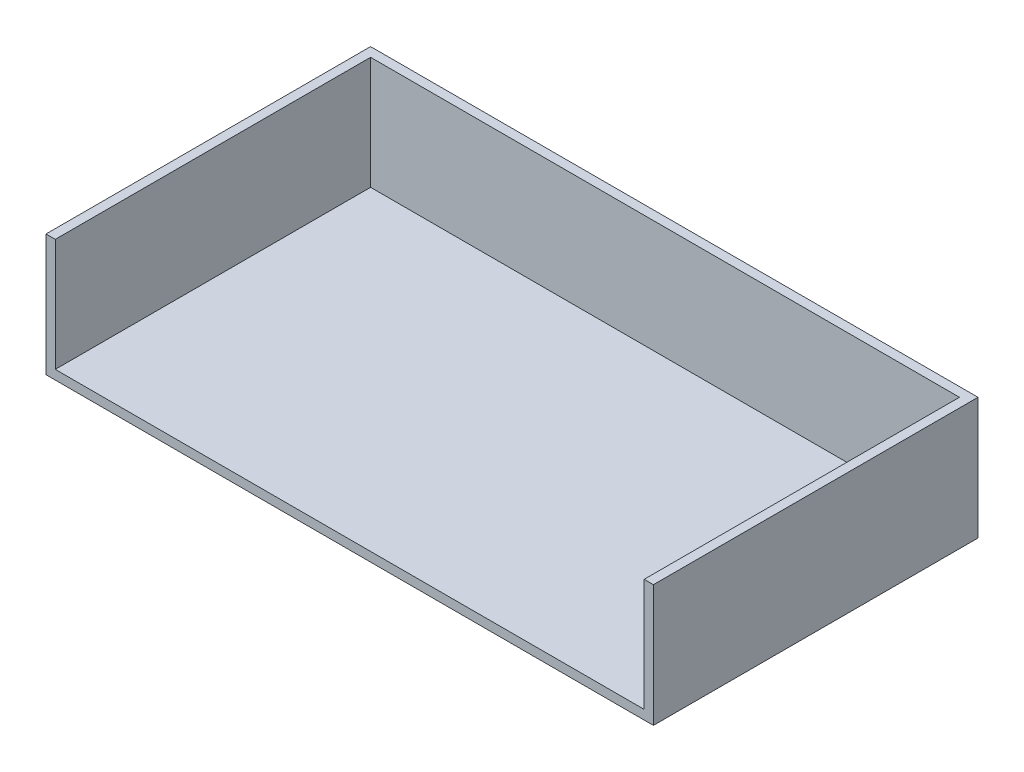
ISO-10303-21;
HEADER;
FILE_DESCRIPTION(('STEP AP214'),'2;1');
FILE_NAME('part.step','',(''),(''),'','','');
FILE_SCHEMA(('AUTOMOTIVE_DESIGN { 1 0 10303 214 1 1 1 1 }'));
ENDSEC;
DATA;
#1=APPLICATION_CONTEXT('core data for automotive mechanical design processes');
#2=APPLICATION_PROTOCOL_DEFINITION('international standard','automotive_design',2000,#1);
#3=PRODUCT_CONTEXT('',#1,'mechanical');
#4=PRODUCT('Part','Part','',(#3));
#5=PRODUCT_RELATED_PRODUCT_CATEGORY('part','',(#4));
#6=PRODUCT_DEFINITION_FORMATION('','',#4);
#7=PRODUCT_DEFINITION_CONTEXT('part definition',#1,'design');
#8=PRODUCT_DEFINITION('design','',#6,#7);
#9=PRODUCT_DEFINITION_SHAPE('','',#8);
#10=(LENGTH_UNIT() NAMED_UNIT(*) SI_UNIT(.MILLI.,.METRE.));
#11=(NAMED_UNIT(*) PLANE_ANGLE_UNIT() SI_UNIT($,.RADIAN.));
#12=(NAMED_UNIT(*) SI_UNIT($,.STERADIAN.) SOLID_ANGLE_UNIT());
#13=UNCERTAINTY_MEASURE_WITH_UNIT(LENGTH_MEASURE(1.E-05),#10,'distance_accuracy_value','');
#14=(GEOMETRIC_REPRESENTATION_CONTEXT(3) GLOBAL_UNCERTAINTY_ASSIGNED_CONTEXT((#13)) GLOBAL_UNIT_ASSIGNED_CONTEXT((#10,
#11,#12)) REPRESENTATION_CONTEXT('',''));
#15=CARTESIAN_POINT('',(0.,0.,0.));
#16=DIRECTION('',(0.,0.,1.));
#17=DIRECTION('',(1.,0.,0.));
#18=AXIS2_PLACEMENT_3D('',#15,#16,#17);
#19=CARTESIAN_POINT('',(0.,0.,70.));
#20=DIRECTION('',(1.,0.,0.));
#21=DIRECTION('',(0.,0.,-1.));
#22=AXIS2_PLACEMENT_3D('',#19,#20,#21);
#23=PLANE('',#22);
#24=DIRECTION('',(0.,-1.,0.));
#25=VECTOR('',#24,1.);
#26=CARTESIAN_POINT('',(0.,0.,0.));
#27=LINE('',#26,#25);
#28=CARTESIAN_POINT('',(0.,26.29,0.));
#29=VERTEX_POINT('',#28);
#30=CARTESIAN_POINT('',(0.,0.,0.));
#31=VERTEX_POINT('',#30);
#32=EDGE_CURVE('E138',#29,#31,#27,.T.);
#33=ORIENTED_EDGE('',*,*,#32,.T.);
#34=DIRECTION('',(0.,0.,-1.));
#35=VECTOR('',#34,1.);
#36=CARTESIAN_POINT('',(0.,0.,70.));
#37=LINE('',#36,#35);
#38=CARTESIAN_POINT('',(0.,0.,70.));
#39=VERTEX_POINT('',#38);
#40=EDGE_CURVE('E11',#39,#31,#37,.T.);
#41=ORIENTED_EDGE('',*,*,#40,.F.);
#42=DIRECTION('',(0.,-1.,0.));
#43=VECTOR('',#42,1.);
#44=CARTESIAN_POINT('',(0.,0.,70.));
#45=LINE('',#44,#43);
#46=CARTESIAN_POINT('',(0.,26.29,70.));
#47=VERTEX_POINT('',#46);
#48=EDGE_CURVE('E131',#47,#39,#45,.T.);
#49=ORIENTED_EDGE('',*,*,#48,.F.);
#50=DIRECTION('',(0.,0.,-1.));
#51=VECTOR('',#50,1.);
#52=CARTESIAN_POINT('',(0.,26.29,70.));
#53=LINE('',#52,#51);
#54=EDGE_CURVE('E137',#47,#29,#53,.T.);
#55=ORIENTED_EDGE('',*,*,#54,.T.);
#56=EDGE_LOOP('',(#33,#41,#49,#55));
#57=FACE_BOUND('',#56,.T.);
#58=ADVANCED_FACE('F31',(#57),#23,.F.);
#59=CARTESIAN_POINT('',(0.,0.,70.));
#60=DIRECTION('',(0.,1.,0.));
#61=DIRECTION('',(0.,0.,1.));
#62=AXIS2_PLACEMENT_3D('',#59,#60,#61);
#63=PLANE('',#62);
#64=DIRECTION('',(1.,0.,0.));
#65=VECTOR('',#64,1.);
#66=CARTESIAN_POINT('',(0.,0.,0.));
#67=LINE('',#66,#65);
#68=CARTESIAN_POINT('',(131.,0.,0.));
#69=VERTEX_POINT('',#68);
#70=EDGE_CURVE('E141',#31,#69,#67,.T.);
#71=ORIENTED_EDGE('',*,*,#70,.T.);
#72=DIRECTION('',(0.,0.,-1.));
#73=VECTOR('',#72,1.);
#74=CARTESIAN_POINT('',(131.,0.,70.));
#75=LINE('',#74,#73);
#76=CARTESIAN_POINT('',(131.,0.,70.));
#77=VERTEX_POINT('',#76);
#78=EDGE_CURVE('E38',#77,#69,#75,.T.);
#79=ORIENTED_EDGE('',*,*,#78,.F.);
#80=DIRECTION('',(1.,0.,0.));
#81=VECTOR('',#80,1.);
#82=CARTESIAN_POINT('',(0.,0.,70.));
#83=LINE('',#82,#81);
#84=EDGE_CURVE('E83',#39,#77,#83,.T.);
#85=ORIENTED_EDGE('',*,*,#84,.F.);
#86=ORIENTED_EDGE('',*,*,#40,.T.);
#87=EDGE_LOOP('',(#71,#79,#85,#86));
#88=FACE_BOUND('',#87,.T.);
#89=ADVANCED_FACE('F185',(#88),#63,.F.);
#90=CARTESIAN_POINT('',(131.,0.,70.));
#91=DIRECTION('',(-1.,0.,0.));
#92=DIRECTION('',(0.,0.,1.));
#93=AXIS2_PLACEMENT_3D('',#90,#91,#92);
#94=PLANE('',#93);
#95=DIRECTION('',(0.,1.,0.));
#96=VECTOR('',#95,1.);
#97=CARTESIAN_POINT('',(131.,0.,0.));
#98=LINE('',#97,#96);
#99=CARTESIAN_POINT('',(131.,26.29,0.));
#100=VERTEX_POINT('',#99);
#101=EDGE_CURVE('E144',#69,#100,#98,.T.);
#102=ORIENTED_EDGE('',*,*,#101,.T.);
#103=DIRECTION('',(0.,0.,-1.));
#104=VECTOR('',#103,1.);
#105=CARTESIAN_POINT('',(131.,26.29,70.));
#106=LINE('',#105,#104);
#107=CARTESIAN_POINT('',(131.,26.29,70.));
#108=VERTEX_POINT('',#107);
#109=EDGE_CURVE('E148',#108,#100,#106,.T.);
#110=ORIENTED_EDGE('',*,*,#109,.F.);
#111=DIRECTION('',(0.,1.,0.));
#112=VECTOR('',#111,1.);
#113=CARTESIAN_POINT('',(131.,0.,70.));
#114=LINE('',#113,#112);
#115=EDGE_CURVE('E134',#77,#108,#114,.T.);
#116=ORIENTED_EDGE('',*,*,#115,.F.);
#117=ORIENTED_EDGE('',*,*,#78,.T.);
#118=EDGE_LOOP('',(#102,#110,#116,#117));
#119=FACE_BOUND('',#118,.T.);
#120=ADVANCED_FACE('F153',(#119),#94,.F.);
#121=CARTESIAN_POINT('',(0.,26.29,70.));
#122=DIRECTION('',(0.,-1.,0.));
#123=DIRECTION('',(0.,0.,-1.));
#124=AXIS2_PLACEMENT_3D('',#121,#122,#123);
#125=PLANE('',#124);
#126=DIRECTION('',(-1.,0.,0.));
#127=VECTOR('',#126,1.);
#128=CARTESIAN_POINT('',(0.,26.29,70.));
#129=LINE('',#128,#127);
#130=CARTESIAN_POINT('',(2.00000000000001,26.29,70.));
#131=VERTEX_POINT('',#130);
#132=EDGE_CURVE('E54',#131,#47,#129,.T.);
#133=ORIENTED_EDGE('',*,*,#132,.F.);
#134=DIRECTION('',(0.,0.,1.));
#135=VECTOR('',#134,1.);
#136=CARTESIAN_POINT('',(2.,26.29,2.));
#137=LINE('',#136,#135);
#138=CARTESIAN_POINT('',(2.,26.29,2.));
#139=VERTEX_POINT('',#138);
#140=EDGE_CURVE('E119',#139,#131,#137,.T.);
#141=ORIENTED_EDGE('',*,*,#140,.F.);
#142=DIRECTION('',(-1.,0.,0.));
#143=VECTOR('',#142,1.);
#144=CARTESIAN_POINT('',(2.,26.29,2.));
#145=LINE('',#144,#143);
#146=CARTESIAN_POINT('',(129.,26.29,2.));
#147=VERTEX_POINT('',#146);
#148=EDGE_CURVE('E165',#147,#139,#145,.T.);
#149=ORIENTED_EDGE('',*,*,#148,.F.);
#150=DIRECTION('',(0.,0.,-1.));
#151=VECTOR('',#150,1.);
#152=CARTESIAN_POINT('',(129.,26.29,2.));
#153=LINE('',#152,#151);
#154=CARTESIAN_POINT('',(129.,26.29,70.));
#155=VERTEX_POINT('',#154);
#156=EDGE_CURVE('E168',#155,#147,#153,.T.);
#157=ORIENTED_EDGE('',*,*,#156,.F.);
#158=EDGE_CURVE('E124',#108,#155,#129,.T.);
#159=ORIENTED_EDGE('',*,*,#158,.F.);
#160=ORIENTED_EDGE('',*,*,#109,.T.);
#161=DIRECTION('',(-1.,0.,0.));
#162=VECTOR('',#161,1.);
#163=CARTESIAN_POINT('',(0.,26.29,0.));
#164=LINE('',#163,#162);
#165=EDGE_CURVE('E76',#100,#29,#164,.T.);
#166=ORIENTED_EDGE('',*,*,#165,.T.);
#167=ORIENTED_EDGE('',*,*,#54,.F.);
#168=EDGE_LOOP('',(#133,#141,#149,#157,#159,#160,#166,#167));
#169=FACE_BOUND('',#168,.T.);
#170=ADVANCED_FACE('F161',(#169),#125,.F.);
#171=CARTESIAN_POINT('',(0.,26.29,70.));
#172=DIRECTION('',(0.,0.,-1.));
#173=DIRECTION('',(-1.,0.,0.));
#174=AXIS2_PLACEMENT_3D('',#171,#172,#173);
#175=PLANE('',#174);
#176=DIRECTION('',(1.,0.,0.));
#177=VECTOR('',#176,1.);
#178=CARTESIAN_POINT('',(2.00000000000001,2.,70.));
#179=LINE('',#178,#177);
#180=CARTESIAN_POINT('',(2.,2.,70.));
#181=VERTEX_POINT('',#180);
#182=CARTESIAN_POINT('',(129.,2.,70.));
#183=VERTEX_POINT('',#182);
#184=EDGE_CURVE('E115',#181,#183,#179,.T.);
#185=ORIENTED_EDGE('',*,*,#184,.F.);
#186=DIRECTION('',(0.,1.,0.));
#187=VECTOR('',#186,1.);
#188=CARTESIAN_POINT('',(2.00000000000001,2.,70.));
#189=LINE('',#188,#187);
#190=EDGE_CURVE('E142',#181,#131,#189,.T.);
#191=ORIENTED_EDGE('',*,*,#190,.T.);
#192=ORIENTED_EDGE('',*,*,#132,.T.);
#193=ORIENTED_EDGE('',*,*,#48,.T.);
#194=ORIENTED_EDGE('',*,*,#84,.T.);
#195=ORIENTED_EDGE('',*,*,#115,.T.);
#196=ORIENTED_EDGE('',*,*,#158,.T.);
#197=DIRECTION('',(0.,1.,0.));
#198=VECTOR('',#197,1.);
#199=CARTESIAN_POINT('',(129.,2.,70.));
#200=LINE('',#199,#198);
#201=EDGE_CURVE('E110',#183,#155,#200,.T.);
#202=ORIENTED_EDGE('',*,*,#201,.F.);
#203=EDGE_LOOP('',(#185,#191,#192,#193,#194,#195,#196,#202));
#204=FACE_BOUND('',#203,.T.);
#205=ADVANCED_FACE('F122',(#204),#175,.F.);
#206=CARTESIAN_POINT('',(0.,26.29,0.));
#207=DIRECTION('',(0.,0.,-1.));
#208=DIRECTION('',(-1.,0.,0.));
#209=AXIS2_PLACEMENT_3D('',#206,#207,#208);
#210=PLANE('',#209);
#211=ORIENTED_EDGE('',*,*,#32,.F.);
#212=ORIENTED_EDGE('',*,*,#165,.F.);
#213=ORIENTED_EDGE('',*,*,#101,.F.);
#214=ORIENTED_EDGE('',*,*,#70,.F.);
#215=EDGE_LOOP('',(#211,#212,#213,#214));
#216=FACE_BOUND('',#215,.T.);
#217=ADVANCED_FACE('F157',(#216),#210,.T.);
#218=CARTESIAN_POINT('',(2.,2.,2.));
#219=DIRECTION('',(-1.,0.,0.));
#220=DIRECTION('',(0.,0.,1.));
#221=AXIS2_PLACEMENT_3D('',#218,#219,#220);
#222=PLANE('',#221);
#223=ORIENTED_EDGE('',*,*,#140,.T.);
#224=ORIENTED_EDGE('',*,*,#190,.F.);
#225=DIRECTION('',(0.,0.,1.));
#226=VECTOR('',#225,1.);
#227=CARTESIAN_POINT('',(2.,2.,2.));
#228=LINE('',#227,#226);
#229=CARTESIAN_POINT('',(2.,2.,2.));
#230=VERTEX_POINT('',#229);
#231=EDGE_CURVE('E45',#230,#181,#228,.T.);
#232=ORIENTED_EDGE('',*,*,#231,.F.);
#233=DIRECTION('',(0.,1.,0.));
#234=VECTOR('',#233,1.);
#235=CARTESIAN_POINT('',(2.,2.,2.));
#236=LINE('',#235,#234);
#237=EDGE_CURVE('E126',#230,#139,#236,.T.);
#238=ORIENTED_EDGE('',*,*,#237,.T.);
#239=EDGE_LOOP('',(#223,#224,#232,#238));
#240=FACE_BOUND('',#239,.T.);
#241=ADVANCED_FACE('F172',(#240),#222,.F.);
#242=CARTESIAN_POINT('',(2.,2.,2.));
#243=DIRECTION('',(0.,0.,-1.));
#244=DIRECTION('',(-1.,0.,0.));
#245=AXIS2_PLACEMENT_3D('',#242,#243,#244);
#246=PLANE('',#245);
#247=ORIENTED_EDGE('',*,*,#148,.T.);
#248=ORIENTED_EDGE('',*,*,#237,.F.);
#249=DIRECTION('',(-1.,0.,0.));
#250=VECTOR('',#249,1.);
#251=CARTESIAN_POINT('',(2.,2.,2.));
#252=LINE('',#251,#250);
#253=CARTESIAN_POINT('',(129.,2.,2.));
#254=VERTEX_POINT('',#253);
#255=EDGE_CURVE('E114',#254,#230,#252,.T.);
#256=ORIENTED_EDGE('',*,*,#255,.F.);
#257=DIRECTION('',(0.,1.,0.));
#258=VECTOR('',#257,1.);
#259=CARTESIAN_POINT('',(129.,2.,2.));
#260=LINE('',#259,#258);
#261=EDGE_CURVE('E112',#254,#147,#260,.T.);
#262=ORIENTED_EDGE('',*,*,#261,.T.);
#263=EDGE_LOOP('',(#247,#248,#256,#262));
#264=FACE_BOUND('',#263,.T.);
#265=ADVANCED_FACE('F174',(#264),#246,.F.);
#266=CARTESIAN_POINT('',(129.,2.,2.));
#267=DIRECTION('',(1.,0.,0.));
#268=DIRECTION('',(0.,0.,-1.));
#269=AXIS2_PLACEMENT_3D('',#266,#267,#268);
#270=PLANE('',#269);
#271=ORIENTED_EDGE('',*,*,#156,.T.);
#272=ORIENTED_EDGE('',*,*,#261,.F.);
#273=DIRECTION('',(0.,0.,-1.));
#274=VECTOR('',#273,1.);
#275=CARTESIAN_POINT('',(129.,2.,2.));
#276=LINE('',#275,#274);
#277=EDGE_CURVE('E106',#183,#254,#276,.T.);
#278=ORIENTED_EDGE('',*,*,#277,.F.);
#279=ORIENTED_EDGE('',*,*,#201,.T.);
#280=EDGE_LOOP('',(#271,#272,#278,#279));
#281=FACE_BOUND('',#280,.T.);
#282=ADVANCED_FACE('F108',(#281),#270,.F.);
#283=CARTESIAN_POINT('',(129.,2.,70.));
#284=DIRECTION('',(0.,-1.,0.));
#285=DIRECTION('',(0.,0.,-1.));
#286=AXIS2_PLACEMENT_3D('',#283,#284,#285);
#287=PLANE('',#286);
#288=ORIENTED_EDGE('',*,*,#184,.T.);
#289=ORIENTED_EDGE('',*,*,#277,.T.);
#290=ORIENTED_EDGE('',*,*,#255,.T.);
#291=ORIENTED_EDGE('',*,*,#231,.T.);
#292=EDGE_LOOP('',(#288,#289,#290,#291));
#293=FACE_BOUND('',#292,.T.);
#294=ADVANCED_FACE('F118',(#293),#287,.F.);
#295=CLOSED_SHELL('',(#58,#89,#120,#170,#205,#217,#241,#265,#282,#294));
#296=MANIFOLD_SOLID_BREP('B2',#295);
#297=ADVANCED_BREP_SHAPE_REPRESENTATION('',(#18,#296),#14);
#298=SHAPE_DEFINITION_REPRESENTATION(#9,#297);
ENDSEC;
END-ISO-10303-21;
